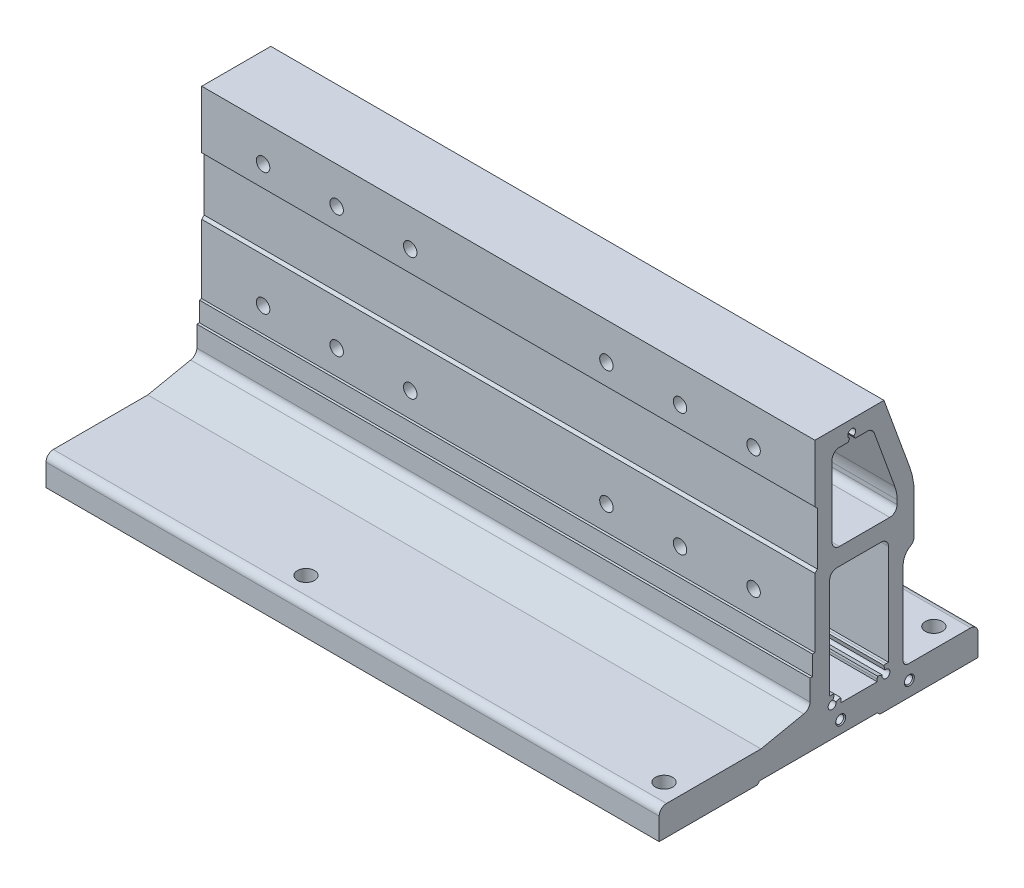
from build123d import *

# Parameters (mm, degrees)
EXTRUDE_1_DEPTH              = 125
HOLE_WIZARD_M5_1_D           = 5.5
HOLE_WIZARD_M5_1_CBORE_D     = 9.5
HOLE_WIZARD_M5_1_CBORE_DEPTH = 34.5
PATTERN_LINEAR_1_COUNT       = 2
PATTERN_LINEAR_1_PITCH       = 140
HOLE_WIZARD_M4_1_D           = 3.3
HOLE_WIZARD_M4_1_DEPTH       = 10
HOLE_WIZARD_M4_1_CSINK_D     = 4.05
HOLE_WIZARD_M4_1_CSINK_ANGLE = 90
HOLE_WIZARD_M4_1_TIP         = 0.991420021
F_5_0MM_1_D                  = 5
F_5_0MM_1_DEPTH              = 10
F_5_0MM_1_TIP                = 1.502151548
HOLE_WIZARD_7_0_7_1_D        = 7


with BuildPart() as part:
    # Sketch 1 → Extrude 1 (new, symmetric)
    with BuildSketch(Plane(origin=(0, 0, 0), x_dir=(0, 0, -1), z_dir=(1, 0, 0))):
        with BuildLine():
            Line((26.665451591, 109), (-1.5, 109))
            Line((-1.5, 109), (-1.5, 85.5))
            Line((-1.5, 85.5), (-0.5, 84.5))
            Line((-0.5, 84.5), (-0.5, 63))
            Line((-0.5, 63), (-1.5, 62))
            Line((-1.5, 62), (-1.5, 34))
            Line((-1.5, 34), (-2.5, 34))
            Line((-2.5, 34), (-2.5, 26))
            Line((-2.5, 26), (-3.5, 26))
            Line((-3.5, 26), (-3.5, 17.566096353))
            ThreePointArc((-3.5, 17.566096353), (-4.220229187, 15.616059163), (-6.035096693, 14.602337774))
            Line((-6.035096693, 14.602337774), (-23.5, 11))
            Line((-23.5, 11), (-62, 11))
            ThreePointArc((-62, 11), (-64.121320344, 10.121320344), (-65, 8))
            Line((-65, 8), (-65, -1))
            Line((-65, -1), (-25, -1))
            Line((-25, -1), (-24, 0))
            Line((-24, 0), (24, 0))
            Line((24, 0), (25, -1))
            Line((25, -1), (65, -1))
            Line((65, -1), (65, 8))
            ThreePointArc((65, 8), (64.121320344, 10.121320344), (62, 11))
            Line((62, 11), (36.5, 11))
            ThreePointArc((36.5, 11), (35.085786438, 11.585786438), (34.5, 13))
            Line((34.5, 13), (34.5, 47))
            ThreePointArc((34.5, 47), (35.303847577, 50), (37.5, 52.196152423))
            ThreePointArc((37.5, 52.196152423), (38.598076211, 53.294228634), (39, 54.794228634))
            Line((39, 54.794228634), (39, 69.821297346))
            ThreePointArc((39, 69.821297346), (38.54423259, 75.030742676), (37.190778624, 80.081901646))
            Line((37.190778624, 80.081901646), (26.665451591, 109))
        make_face()
        with BuildLine():
            Line((25.5, 59.5), (7.5, 59.5))
            ThreePointArc((7.5, 59.5), (5.378679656, 58.621320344), (4.5, 56.5))
            Line((4.5, 56.5), (4.5, 15.6))
            Line((4.5, 15.6), (5.5, 15.6))
            ThreePointArc((5.5, 15.6), (5.969894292, 15.569201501), (6.431748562, 15.477332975))
            Line((6.431748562, 15.477332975), (5.914110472, 13.545481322))
            ThreePointArc((5.914110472, 13.545481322), (4.36862915, 10.86862915), (7.045481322, 12.414110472))
            Line((7.045481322, 12.414110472), (8.977332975, 12.931748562))
            ThreePointArc((8.977332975, 12.931748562), (9.069201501, 12.469894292), (9.1, 12))
            Line((9.1, 12), (9.1, 11))
            Line((9.1, 11), (23.9, 11))
            Line((23.9, 11), (23.9, 12))
            ThreePointArc((23.9, 12), (23.930798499, 12.469894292), (24.022667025, 12.931748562))
            Line((24.022667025, 12.931748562), (25.954518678, 12.414110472))
            ThreePointArc((25.954518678, 12.414110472), (28.63137085, 10.86862915), (27.085889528, 13.545481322))
            Line((27.085889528, 13.545481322), (26.568251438, 15.477332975))
            ThreePointArc((26.568251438, 15.477332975), (27.030105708, 15.569201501), (27.5, 15.6))
            Line((27.5, 15.6), (28.5, 15.6))
            Line((28.5, 15.6), (28.5, 56.5))
            ThreePointArc((28.5, 56.5), (27.621320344, 58.621320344), (25.5, 59.5))
        make_face(mode=Mode.SUBTRACT)
        with BuildLine():
            Line((12.7, 102.614356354), (12.056626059, 101.5))
            Line((12.056626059, 101.5), (8.5, 101.5))
            ThreePointArc((8.5, 101.5), (6.378679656, 100.621320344), (5.5, 98.5))
            Line((5.5, 98.5), (5.5, 69.5))
            ThreePointArc((5.5, 69.5), (6.378679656, 67.378679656), (8.5, 66.5))
            Line((8.5, 66.5), (29, 66.5))
            ThreePointArc((29, 66.5), (31.121320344, 67.378679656), (32, 69.5))
            Line((32, 69.5), (32, 71.231913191))
            ThreePointArc((32, 71.231913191), (31.772116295, 73.836635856), (31.095389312, 76.362215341))
            Line((31.095389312, 76.362215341), (22.664439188, 99.52606043))
            ThreePointArc((22.664439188, 99.52606043), (21.566090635, 100.957456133), (19.845361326, 101.5))
            Line((19.845361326, 101.5), (14.943373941, 101.5))
            Line((14.943373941, 101.5), (14.3, 102.614356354))
            ThreePointArc((14.3, 102.614356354), (13.5, 105.599997), (12.7, 102.614356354))
        make_face(mode=Mode.SUBTRACT)
    extrude(amount=EXTRUDE_1_DEPTH, both=True)

    # Hole Wizard M5 _ _ _ _ _1 (through all)
    with Locations(Plane(origin=(0, 0, -39), x_dir=(-1, 0, 0), z_dir=(0, 0, -1))):
        with Locations((-100, 94), (-70, 94), (-40, 94), (-100, 44), (-70, 44), (-40, 44)):
            hole_wizard_m5_1 = CounterBoreHole(HOLE_WIZARD_M5_1_D / 2, HOLE_WIZARD_M5_1_CBORE_D / 2, HOLE_WIZARD_M5_1_CBORE_DEPTH)

    # Pattern Linear 1: Hole Wizard M5 _ _ _ _ _1 ×2
    with Locations(*[(-i * PATTERN_LINEAR_1_PITCH, 0, 0) for i in range(1, PATTERN_LINEAR_1_COUNT)]):
        add(hole_wizard_m5_1, mode=Mode.SUBTRACT)

    # Hole Wizard M4 _ _1
    with Locations(Plane(origin=(125, 0, 0), x_dir=(0, 0, -1), z_dir=(1, 0, 0))):
        with Locations((37, 5), (9, 5)):
            CounterSinkHole(HOLE_WIZARD_M4_1_D / 2, HOLE_WIZARD_M4_1_CSINK_D / 2, depth=HOLE_WIZARD_M4_1_DEPTH, counter_sink_angle=HOLE_WIZARD_M4_1_CSINK_ANGLE)
            with Locations((0, 0, -(HOLE_WIZARD_M4_1_DEPTH + HOLE_WIZARD_M4_1_TIP / 2))):  # 118° drill point
                Cone(0, HOLE_WIZARD_M4_1_D / 2, HOLE_WIZARD_M4_1_TIP, mode=Mode.SUBTRACT)

    # 5.0mm _ _1
    with Locations(Plane(origin=(0, 0, 0), x_dir=(-1, 0, 0), z_dir=(0, -1, 0))):
        with Locations((29, 0), (-117, 0)):
            Hole(F_5_0MM_1_D / 2, depth=F_5_0MM_1_DEPTH)
            with Locations((0, 0, -(F_5_0MM_1_DEPTH + F_5_0MM_1_TIP / 2))):  # 118° drill point
                Cone(0, F_5_0MM_1_D / 2, F_5_0MM_1_TIP, mode=Mode.SUBTRACT)

    # Hole Wizard 7.0 _7_ _ _1 (through all)
    with Locations(Plane(origin=(0, -1, 0), x_dir=(-1, 0, 0), z_dir=(0, -1, 0))):
        with Locations((29, -55), (-117, -55), (29, 55), (-117, 55)):
            Hole(HOLE_WIZARD_7_0_7_1_D / 2)


solid = part.part
